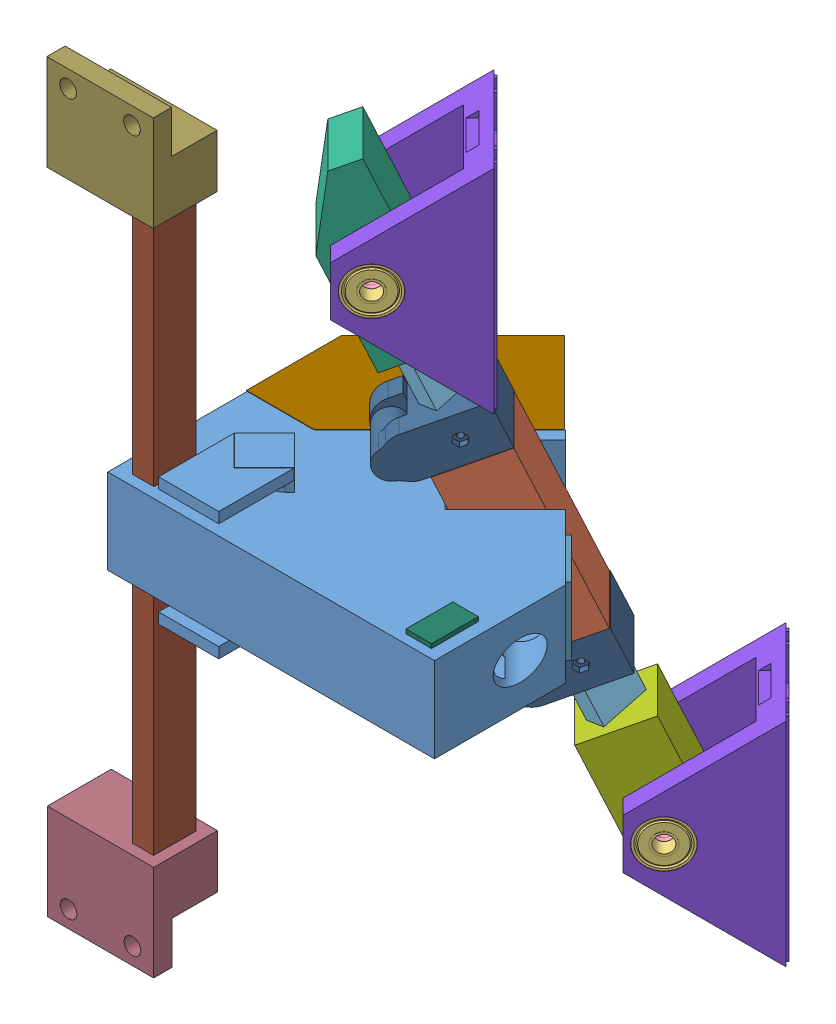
SolidWorks assembly pedals.SLDASM, configuration По умолчанию (file format 9000). Lengths in mm.
Overall size (209.94 350 179.11).
29 component instances, 15 part files, 73 mates.
Components (placement in the parent):
- frame-2: frame.SLDPRT [По умолчанию] at origin size (153.62 60 126.14)
- rocker_frame-1: rocker_frame.SLDPRT [По умолчанию] at (-23.0827 20 -33.0357) x (0.280847 -0.917742 -0.280847) z (-0.648942 -0.397177 0.648942) size (80 33.2 30)
- 608_bearing_v1-1: 608_bearing_v1.SLDPRT [По умолчанию] at (-27.6081 20 -37.5612) x (0.67617 0.292553 -0.67617) z (-0.206866 0.956249 0.206866) size (22 7.15 22)
- 608_bearing_v1-2: 608_bearing_v1.SLDPRT [По умолчанию] at (4.9188 20 -5.0343) x (0.5 -0.707107 -0.5) z (-0.5 -0.707107 0.5) size (22 7.15 22)
- m8_nut-1: m8_nut.SLDPRT [По умолчанию] at (0.3933 20 -9.5598) x (0.5 -0.707107 -0.5) z (-0.5 -0.707107 0.5) size (14.4 6.3 12.56)
- m8_nut-2: m8_nut.SLDPRT [По умолчанию] at (-27.5374 20 -37.4905) x (0.5 -0.707107 -0.5) z (-0.5 -0.707107 0.5) size (14.4 6.3 12.56)
- aluminium_rectangular_pipe_10x20x100mm-1: aluminium_rectangular_pipe_10x20x100mm.SLDPRT [По умолчанию] at (-14.053 29.2334 -18.572) x (0.958807 0.255301 0.124544) z (-0.042599 -0.304255 0.951638) size (10 100 20)
- aluminium_rectangular_pipe_10x20x100mm-2: aluminium_rectangular_pipe_10x20x100mm.SLDPRT [По умолчанию] at (19.6486 -80.8957 -52.2736) x (0.958807 0.255301 0.124544) z (-0.042599 -0.304255 0.951638) size (10 100 20)
- pedal_mount_left-1: pedal_mount_left.SLDPRT [По умолчанию] at (-30.0267 116.4748 18.6324) x (0.280847 -0.917742 -0.280847) z (0.648942 0.397177 -0.648942) size (82 30 30)
- pedal_mount_right-2: pedal_mount_right.SLDPRT [По умолчанию] at (27.5384 -71.7231 -38.7509) x (-0.280847 0.917742 0.280847) z (-0.648942 -0.397177 0.648942) size (82 30 30)
- m8_nut-3: m8_nut.SLDPRT [По умолчанию] at (-31.1889 134.8296 28.7041) x (0.5 0.707107 -0.5) z (-0.5 0.707107 0.5) size (14.4 6.3 12.56)
- m8_nut-4: m8_nut.SLDPRT [По умолчанию] at (-56.8569 134.8296 3.0361) x (0.5 0.707107 -0.5) z (-0.5 0.707107 0.5) size (14.4 6.3 12.56)
- m8_nut-5: m8_nut.SLDPRT [По умолчанию] at (11.9421 -90.078 -65.581) x (0.5 0.707107 -0.5) z (-0.5 0.707107 0.5) size (14.4 6.3 12.56)
- m8_nut-6: m8_nut.SLDPRT [По умолчанию] at (37.6101 -90.078 -39.9131) x (0.5 0.707107 -0.5) z (-0.5 0.707107 0.5) size (14.4 6.3 12.56)
- 608_bearing_v1-3: 608_bearing_v1.SLDPRT [По умолчанию] at (-61.3823 134.8296 -1.4894) x (0.5 0.707107 -0.5) z (-0.5 0.707107 0.5) size (22 7.15 22)
- 608_bearing_v1-4: 608_bearing_v1.SLDPRT [По умолчанию] at (-31.1182 134.8296 28.7748) x (0.699017 -0.15083 -0.699017) z (-0.106653 -0.98856 0.106653) size (22 7.15 22)
- 608_bearing_v1-5: 608_bearing_v1.SLDPRT [По умолчанию] at (37.6808 -90.078 -39.8424) x (0.5 -0.707107 -0.5) z (-0.5 -0.707107 0.5) size (22 7.15 22)
- 608_bearing_v1-6: 608_bearing_v1.SLDPRT [По умолчанию] at (2.5022 -90.078 -75.0209) x (0.497237 -0.710992 -0.497237) z (-0.502747 -0.7032 0.502747) size (22 7.15 22)
- pedal-2: pedal.SLDPRT [По умолчанию] at (-27.5826 134.8296 -25.1068) x (0 -1 0) z (-0.707107 0 -0.707107) size (100 55.23 56.8)
- pedal-3: pedal.SLDPRT [По умолчанию] at (41.2163 -90.078 -93.7239) x (0 -1 0) z (-0.707107 0 -0.707107) size (100 55.23 56.8)
- cover-1: cover.SLDPRT [По умолчанию] at (-66.5631 0.2 -0.5407) size (90.66 40 97.19)
- rubber_bands_holder-1: rubber_bands_holder.SLDPRT [По умолчанию] at (-8.8384 -25.7635 -47.28) x (-0.280847 0.917742 0.280847) z (0.648942 0.397177 -0.648942) size (20 33.2 47)
- rubber_bands_holder-2: rubber_bands_holder.SLDPRT [По умолчанию] at (-37.345 65.8871 -19.2134) x (-0.280847 0.917742 0.280847) z (0.648942 0.397177 -0.648942) size (20 33.2 47)
- aluminium_rectangular_pipe_10x20x300mm-2: aluminium_rectangular_pipe_10x20x300mm.SLDPRT [По умолчанию] at (-97.7934 -130 59.5347) size (10 300 20)
- pedals_front_frame_leg_left-1: pedals_front_frame_leg_left.SLDPRT [По умолчанию] at (-112.8934 162.5 74.6347) x (0 -1 0) z (1 0 0) size (45 31 50)
- pedals_front_frame_leg_right-1: pedals_front_frame_leg_right.SLDPRT [По умолчанию] at (-112.6934 -122.5 74.6347) x (0 1 0) z (-1 0 0) size (45 31 50)
- front_cover-1: front_cover.SLDPRT [По умолчанию] at (27.1219 19.9 0.1983) x (0 -1 0) z (0.707107 0 0.707107) size (32 5 27)
- side_cover-1: side_cover.SLDPRT [По умолчанию] at (32.5066 35 59.2347) size (12 7 22)
- side_cover-2: side_cover.SLDPRT [По умолчанию] at (32.5066 5 59.2347) x (-1 0 0) z (0 0 1) size (12 7 22)
Mates (geometry in assembly coordinates):
- Concentric1: concentric anti-aligned: cylinder of frame-2 through (62.4421 20 52.4891) axis (-0.707107 0 -0.707107) radius 9; cylinder of rocker_frame-1 through (-23.0827 20 -33.0357) axis (0.707107 0 0.707107) radius 4
- Concentric2: concentric anti-aligned: cylinder of frame-2 through (-27.6081 20 -37.5612) axis (-0.707107 0 -0.707107) radius 11.1; cylinder of 608_bearing_v1-1 through (-30.0653 20 -40.0184) axis (0.707107 0 0.707107) radius 11
- Coincident1: coincident anti-aligned: plane of frame-2 through (-27.6081 20 -37.5612) normal (-0.707107 0 -0.707107); plane of 608_bearing_v1-1 through (-27.6081 20 -37.5612) normal (0.707107 0 0.707107)
- Concentric4: concentric anti-aligned: cylinder of frame-2 through (4.9188 20 -5.0343) axis (0.707107 0 0.707107) radius 11.1; cylinder of 608_bearing_v1-2 through (7.376 20 -2.5771) axis (-0.707107 0 -0.707107) radius 11
- Coincident2: coincident anti-aligned: plane of frame-2 through (4.9188 20 -5.0343) normal (0.707107 0 0.707107); plane of 608_bearing_v1-2 through (4.9188 20 -5.0343) normal (-0.707107 0 -0.707107)
- Concentric5: concentric anti-aligned: cylinder of 608_bearing_v1-1 through (-30.0653 20 -40.0184) axis (0.707107 0 0.707107) radius 4; cylinder of m8_nut-2 through (-23.0827 20 -33.0357) axis (-0.707107 0 -0.707107) radius 3.2
- Coincident3: coincident anti-aligned: plane of 608_bearing_v1-1 through (-27.5374 20 -37.4905) normal (0.707107 0 0.707107); plane of m8_nut-2 through (-27.5374 20 -37.4905) normal (-0.707107 0 -0.707107)
- Coincident4: coincident anti-aligned: plane of rocker_frame-1 through (-23.0827 20 -33.0357) normal (-0.707107 0 -0.707107); plane of m8_nut-2 through (-23.0827 20 -33.0357) normal (0.707107 0 0.707107)
- Concentric6: concentric anti-aligned: cylinder of rocker_frame-1 through (-23.0827 20 -33.0357) axis (0.707107 0 0.707107) radius 4; cylinder of m8_nut-1 through (4.8481 20 -5.105) axis (-0.707107 0 -0.707107) radius 3.2
- Coincident5: coincident anti-aligned: plane of 608_bearing_v1-2 through (4.8481 20 -5.105) normal (-0.707107 0 -0.707107); plane of m8_nut-1 through (4.8481 20 -5.105) normal (0.707107 0 0.707107)
- Coincident6: coincident anti-aligned: plane of rocker_frame-1 through (-8.833 33.5524 -27.4656) normal (-0.042599 -0.304255 0.951638); plane of aluminium_rectangular_pipe_10x20x100mm-1 through (-36.9177 125.3266 0.619) normal (0.042599 0.304255 -0.951638)
- Coincident7: coincident anti-aligned: plane of rocker_frame-1 through (-8.833 33.5524 -27.4656) normal (-0.958807 -0.255301 -0.124544); plane of aluminium_rectangular_pipe_10x20x100mm-1 through (-37.7696 119.2415 19.6518) normal (0.958807 0.255301 0.124544)
- Coincident8: coincident anti-aligned: plane of rocker_frame-1 through (-25.8911 29.1774 -30.2272) normal (-0.280847 0.917742 0.280847); plane of aluminium_rectangular_pipe_10x20x100mm-1 through (-14.053 29.2334 -18.572) normal (0.280847 -0.917742 -0.280847)
- Coincident9: coincident anti-aligned: plane of rocker_frame-1 through (-3.2161 15.1976 -33.0826) normal (-0.958807 -0.255301 -0.124544); plane of aluminium_rectangular_pipe_10x20x100mm-2 through (-4.068 9.1125 -14.0498) normal (0.958807 0.255301 0.124544)
- Coincident10: coincident anti-aligned: plane of rocker_frame-1 through (-20.2742 10.8226 -35.8442) normal (0.280847 -0.917742 -0.280847); plane of aluminium_rectangular_pipe_10x20x100mm-2 through (-8.4361 10.8785 -24.1889) normal (-0.280847 0.917742 0.280847)
- Coincident11: coincident anti-aligned: plane of rocker_frame-1 through (-3.2161 15.1976 -33.0826) normal (-0.042599 -0.304255 0.951638); plane of aluminium_rectangular_pipe_10x20x100mm-2 through (-3.2161 15.1976 -33.0826) normal (0.042599 0.304255 -0.951638)
- Coincident13: coincident anti-aligned: plane of aluminium_rectangular_pipe_10x20x100mm-1 through (-37.7696 119.2415 19.6518) normal (-0.042599 -0.304255 0.951638); plane of pedal_mount_left-1 through (-37.5779 119.2926 19.6767) normal (0.042599 0.304255 -0.951638)
- Coincident14: coincident anti-aligned: plane of aluminium_rectangular_pipe_10x20x100mm-1 through (-47.3577 116.6885 18.4064) normal (-0.958807 -0.255301 -0.124544); plane of pedal_mount_left-1 through (-47.3577 116.6885 18.4064) normal (0.958807 0.255301 0.124544)
- Coincident15: coincident anti-aligned: plane of aluminium_rectangular_pipe_10x20x100mm-1 through (-42.1377 121.0076 9.5127) normal (-0.280847 0.917742 0.280847); plane of pedal_mount_left-1 through (-31.431 121.0635 20.0366) normal (0.280847 -0.917742 -0.280847)
- Parallel2: parallel anti-aligned: plane of aluminium_rectangular_pipe_10x20x100mm-2 through (19.6486 -80.8957 -52.2736) normal (0.280847 -0.917742 -0.280847); plane of pedal_mount_right-2 through (-9.0259 -59.326 -44.6131) normal (-0.280847 0.917742 0.280847)
- Coincident28: coincident anti-aligned: plane of aluminium_rectangular_pipe_10x20x100mm-2 through (-13.6561 6.5595 -15.2953) normal (-0.958807 -0.255301 -0.124544); plane of pedal_mount_right-2 through (15.2806 -79.1296 -62.4127) normal (0.958807 0.255301 0.124544)
- Coincident29: coincident anti-aligned: plane of aluminium_rectangular_pipe_10x20x100mm-2 through (-3.2161 15.1976 -33.0826) normal (0.042599 0.304255 -0.951638); plane of pedal_mount_right-2 through (25.0604 -76.5255 -61.1423) normal (-0.042599 -0.304255 0.951638)
- Coincident30: coincident anti-aligned: plane of aluminium_rectangular_pipe_10x20x100mm-2 through (19.6486 -80.8957 -52.2736) normal (0.280847 -0.917742 -0.280847); plane of pedal_mount_right-2 through (30.3468 -80.9005 -41.5594) normal (-0.280847 0.917742 0.280847)
- Concentric8: concentric anti-aligned: cylinder of pedal_mount_left-1 through (-35.6437 134.8296 24.2493) axis (-0.707107 0 -0.707107) radius 4; cylinder of m8_nut-3 through (-35.6437 134.8296 24.2493) axis (0.707107 0 0.707107) radius 3.2
- Coincident31: coincident anti-aligned: plane of pedal_mount_left-1 through (-30.0267 116.4748 18.6324) normal (0.707107 0 0.707107); plane of m8_nut-3 through (-35.6437 134.8296 24.2493) normal (-0.707107 0 -0.707107)
- Concentric9: concentric anti-aligned: cylinder of pedal_mount_left-1 through (-35.6437 134.8296 24.2493) axis (-0.707107 0 -0.707107) radius 4; cylinder of m8_nut-4 through (-61.3116 134.8296 -1.4187) axis (0.707107 0 0.707107) radius 3.2
- Coincident32: coincident anti-aligned: plane of pedal_mount_left-1 through (-51.2399 116.4748 -2.5808) normal (-0.707107 0 -0.707107); plane of m8_nut-4 through (-56.8569 134.8296 3.0361) normal (0.707107 0 0.707107)
- Concentric10: concentric anti-aligned: cylinder of pedal_mount_right-2 through (33.1553 -90.078 -44.3678) axis (-0.707107 0 -0.707107) radius 4; cylinder of m8_nut-6 through (33.1553 -90.078 -44.3678) axis (0.707107 0 0.707107) radius 3.2
- Coincident33: coincident anti-aligned: plane of pedal_mount_right-2 through (27.5384 -71.7231 -38.7509) normal (0.707107 0 0.707107); plane of m8_nut-6 through (33.1553 -90.078 -44.3678) normal (-0.707107 0 -0.707107)
- Concentric11: concentric anti-aligned: cylinder of pedal_mount_right-2 through (33.1553 -90.078 -44.3678) axis (-0.707107 0 -0.707107) radius 4; cylinder of m8_nut-5 through (7.4873 -90.078 -70.0358) axis (0.707107 0 0.707107) radius 3.2
- Coincident34: coincident anti-aligned: plane of pedal_mount_right-2 through (6.3252 -71.7231 -59.9641) normal (-0.707107 0 -0.707107); plane of m8_nut-5 through (11.9421 -90.078 -65.581) normal (0.707107 0 0.707107)
- Coincident37: coincident anti-aligned: plane of m8_nut-3 through (-31.1889 134.8296 28.7041) normal (0.707107 0 0.707107); plane of 608_bearing_v1-4 through (-31.1889 134.8296 28.7041) normal (-0.707107 0 -0.707107)
- Concentric15: concentric aligned: cylinder of m8_nut-4 through (-61.3116 134.8296 -1.4187) axis (0.707107 0 0.707107) radius 3.2; cylinder of 608_bearing_v1-3 through (-63.8395 134.8296 -3.9466) axis (0.707107 0 0.707107) radius 4
- Coincident38: coincident anti-aligned: plane of m8_nut-4 through (-61.3116 134.8296 -1.4187) normal (-0.707107 0 -0.707107); plane of 608_bearing_v1-3 through (-61.3116 134.8296 -1.4187) normal (0.707107 0 0.707107)
- Concentric16: concentric anti-aligned: cylinder of m8_nut-3 through (-35.6437 134.8296 24.2493) axis (0.707107 0 0.707107) radius 3.2; cylinder of 608_bearing_v1-4 through (-28.661 134.8296 31.232) axis (-0.707107 0 -0.707107) radius 4
- Concentric17: concentric anti-aligned: cylinder of 608_bearing_v1-3 through (-63.8395 134.8296 -3.9466) axis (0.707107 0 0.707107) radius 11; cylinder of pedal-2 through (-61.3823 134.8296 -1.4894) axis (-0.707107 0 -0.707107) radius 11.1
- Coincident39: coincident anti-aligned: plane of 608_bearing_v1-3 through (-61.3823 134.8296 -1.4894) normal (0.707107 0 0.707107); plane of pedal-2 through (-61.3823 134.8296 -1.4894) normal (-0.707107 0 -0.707107)
- Coincident40: coincident: line of frame-2 through (-14.8802 40 10.5221) axis (-0.707107 0 -0.707107); plane of rocker_frame-1 through (-20.5747 50.752 11.4082) normal (-0.648942 -0.397177 0.648942)
- Parallel3: parallel aligned: plane of frame-2 through (-21.9513 40 -53.1175) normal (0.707107 0 -0.707107); plane of pedal-2 through (-27.5826 134.8296 -25.1068) normal (0.707107 0 -0.707107)
- Concentric18: concentric anti-aligned: cylinder of m8_nut-5 through (7.4873 -90.078 -70.0358) axis (0.707107 0 0.707107) radius 3.2; cylinder of 608_bearing_v1-6 through (4.9594 -90.078 -72.5637) axis (-0.707107 0 -0.707107) radius 4
- Concentric19: concentric anti-aligned: cylinder of m8_nut-6 through (33.1553 -90.078 -44.3678) axis (0.707107 0 0.707107) radius 3.2; cylinder of 608_bearing_v1-5 through (40.138 -90.078 -37.3852) axis (-0.707107 0 -0.707107) radius 4
- Coincident42: coincident anti-aligned: plane of m8_nut-6 through (37.6101 -90.078 -39.9131) normal (0.707107 0 0.707107); plane of 608_bearing_v1-5 through (37.6101 -90.078 -39.9131) normal (-0.707107 0 -0.707107)
- Coincident43: coincident anti-aligned: plane of m8_nut-5 through (7.4873 -90.078 -70.0358) normal (-0.707107 0 -0.707107); plane of 608_bearing_v1-6 through (7.4873 -90.078 -70.0358) normal (0.707107 0 0.707107)
- Coincident44: coincident anti-aligned: circle of 608_bearing_v1-6; plane of pedal-3 through (7.4166 -90.078 -70.1065) normal (-0.707107 0 -0.707107)
- Concentric20: concentric anti-aligned: cylinder of 608_bearing_v1-5 through (40.138 -90.078 -37.3852) axis (-0.707107 0 -0.707107) radius 11; cylinder of pedal-3 through (37.6808 -90.078 -39.8424) axis (0.707107 0 0.707107) radius 11.1
- Parallel4: parallel aligned: plane of frame-2 through (-21.9513 40 -53.1175) normal (0.707107 0 -0.707107); plane of pedal-3 through (41.2163 -90.078 -93.7239) normal (0.707107 0 -0.707107)
- Coincident49: coincident anti-aligned: plane of frame-2 through (-75.2609 2 5.8489) normal (0 -1 0); plane of cover-1 through (-20.5371 2 -48.8749) normal (0 1 0)
- Coincident50: coincident anti-aligned: plane of frame-2 through (-20.5371 38 -48.8749) normal (0.707107 0 -0.707107); plane of cover-1 through (-20.5371 38.4 -48.8749) normal (-0.707107 0 0.707107)
- Coincident52: coincident anti-aligned: plane of frame-2 through (-34.706 0 -34.706) normal (-0.707107 0 -0.707107); plane of cover-1 through (-67.7172 0.2 -1.6948) normal (0.707107 0 0.707107)
- Coincident55: coincident anti-aligned: plane of rocker_frame-1 through (1.893 -22.6673 -11.0595) normal (0.280847 -0.917742 -0.280847); plane of rubber_bands_holder-1 through (21.5632 -10.6284 -30.7297) normal (-0.280847 0.917742 0.280847)
- Coincident57: coincident anti-aligned: line of rocker_frame-1 through (-21.5829 -22.6673 -34.5355) axis (0.648942 0.397177 -0.648942); line of rubber_bands_holder-1 through (-1.9128 -10.6284 -54.2056) axis (-0.648942 -0.397177 0.648942)
- Coincident58: coincident anti-aligned: plane of aluminium_rectangular_pipe_10x20x100mm-2 through (-13.6561 6.5595 -15.2953) normal (-0.958807 -0.255301 -0.124544); plane of rubber_bands_holder-1 through (-8.0375 -11.7837 -20.9487) normal (0.958807 0.255301 0.124544)
- Coincident59: coincident anti-aligned: plane of rocker_frame-1 through (-20.5747 50.752 11.4082) normal (-0.280847 0.917742 0.280847); plane of rubber_bands_holder-2 through (-1.3265 62.6673 -8.28) normal (0.280847 -0.917742 -0.280847)
- Coincident60: coincident aligned: line of rocker_frame-1 through (-20.5747 50.752 11.4082) axis (-0.707107 0 -0.707107); line of rubber_bands_holder-2 through (-27.8658 50.752 4.1171) axis (-0.707107 0 -0.707107)
- Coincident61: coincident anti-aligned: plane of aluminium_rectangular_pipe_10x20x100mm-1 through (-37.7696 119.2415 19.6518) normal (-0.042599 -0.304255 0.951638); plane of rubber_bands_holder-2 through (-26.7643 82.471 8.3882) normal (0.042599 0.304255 -0.951638)
- Coincident64: coincident anti-aligned: plane of frame-2 through (-102.7934 0 69.5347) normal (1 0 0); plane of aluminium_rectangular_pipe_10x20x300mm-2 through (-102.7934 170 69.5347) normal (-1 0 0)
- Coincident65: coincident anti-aligned: plane of frame-2 through (-102.7934 0 69.5347) normal (0 0 -1); plane of aluminium_rectangular_pipe_10x20x300mm-2 through (-92.7934 170 69.5347) normal (0 0 1)
- Distance2: distance = 130 mm: line of aluminium_rectangular_pipe_10x20x300mm-2 through (-92.7934 170 49.5347) axis (-1 0 0); plane of frame-2 through (0 40 0) normal (0 1 0)
- Coincident73: coincident anti-aligned: plane of aluminium_rectangular_pipe_10x20x300mm-2 through (-102.7934 170 69.5347) normal (-1 0 0); plane of pedals_front_frame_leg_right-1 through (-102.7934 -130 69.7347) normal (1 0 0)
- Coincident74: coincident anti-aligned: plane of aluminium_rectangular_pipe_10x20x300mm-2 through (-92.7934 170 49.5347) normal (0 0 -1); plane of pedals_front_frame_leg_right-1 through (-92.5934 -130 49.5347) normal (0 0 1)
- Coincident75: coincident anti-aligned: plane of aluminium_rectangular_pipe_10x20x300mm-2 through (-97.7934 -130 59.5347) normal (0 -1 0); plane of pedals_front_frame_leg_right-1 through (-112.6934 -130 74.6347) normal (0 1 0)
- Coincident76: coincident anti-aligned: plane of aluminium_rectangular_pipe_10x20x300mm-2 through (-92.7934 170 69.5347) normal (1 0 0); plane of pedals_front_frame_leg_left-1 through (-92.7934 170 69.7347) normal (-1 0 0)
- Coincident77: coincident anti-aligned: plane of aluminium_rectangular_pipe_10x20x300mm-2 through (-92.7934 170 49.5347) normal (0 0 -1); plane of pedals_front_frame_leg_left-1 through (-102.9934 170 49.5347) normal (0 0 1)
- Coincident78: coincident anti-aligned: plane of aluminium_rectangular_pipe_10x20x300mm-2 through (-97.7934 170 59.5347) normal (0 1 0); plane of pedals_front_frame_leg_left-1 through (-112.8934 170 74.6347) normal (0 -1 0)
- Coincident79: coincident anti-aligned: plane of frame-2 through (-0.7381 5 10.5221) normal (0.707107 0 0.707107); plane of front_cover-1 through (20.4751 5 -10.6911) normal (-0.707107 0 -0.707107)
- Coincident80: coincident anti-aligned: plane of frame-2 through (16.9396 5 28.1997) normal (0 1 0); plane of front_cover-1 through (38.0114 5 6.8451) normal (0 -1 0)
- Coincident81: coincident anti-aligned: plane of frame-2 through (13.404 40 -17.7622) normal (0.707107 0 -0.707107); plane of front_cover-1 through (29.2432 19.9 -1.923) normal (-0.707107 0 0.707107)
- Coincident82: coincident anti-aligned: plane of frame-2 through (37.4066 0 69.5347) normal (-1 0 0); plane of side_cover-1 through (37.4066 40 69.1347) normal (1 0 0)
- Coincident83: coincident anti-aligned: plane of frame-2 through (37.4066 0 49.3347) normal (0 0 1); plane of side_cover-1 through (37.4066 40 49.3347) normal (0 0 -1)
- Coincident84: coincident anti-aligned: plane of frame-2 through (0 40 0) normal (0 1 0); plane of side_cover-1 through (32.5066 40 59.2347) normal (0 -1 0)
- Coincident85: coincident anti-aligned: plane of frame-2 through (37.4066 0 49.3347) normal (0 0 1); plane of side_cover-2 through (27.6066 0 49.3347) normal (0 0 -1)
- Coincident86: coincident anti-aligned: plane of frame-2 through (37.4066 0 69.5347) normal (-1 0 0); plane of side_cover-2 through (37.4066 0 69.1347) normal (1 0 0)
- Coincident87: coincident anti-aligned: plane of frame-2 through (0 0 0) normal (0 -1 0); plane of side_cover-2 through (32.5066 0 59.2347) normal (0 1 0)
